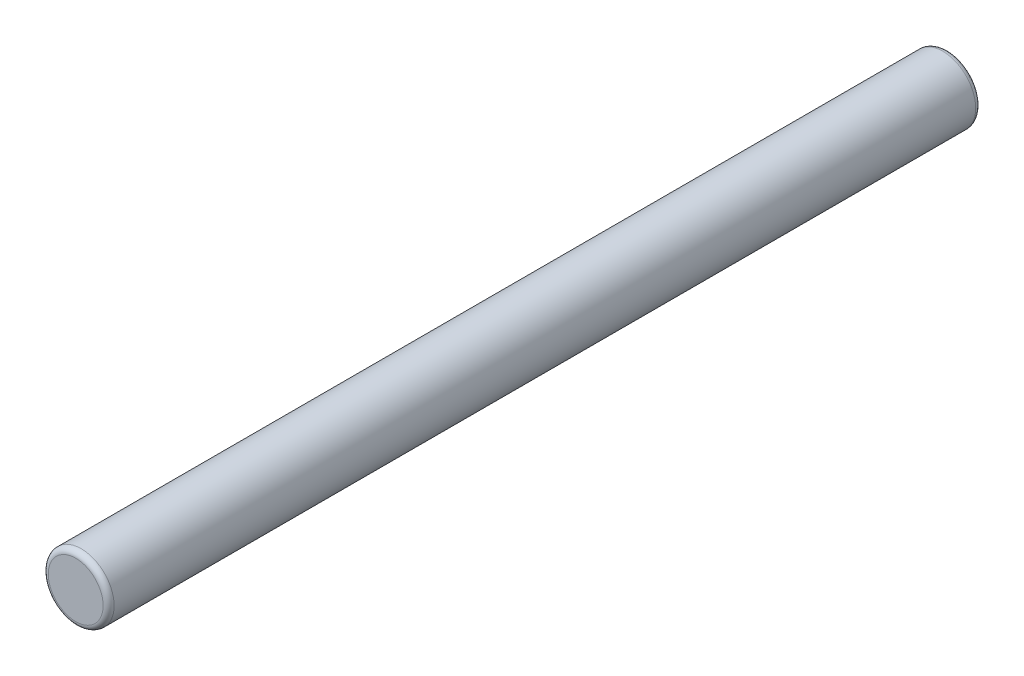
from build123d import *

# Parameters (mm, degrees)
SCHIZZO1_R                   = 6
ESTRUSIONE_ESTRUSIONE1_DEPTH = 79.5
RACCORDO1_R                  = 1


with BuildPart() as part:
    # Schizzo1 → Estrusione-Estrusione1 (new, symmetric)
    with BuildSketch(Plane.XY):
        with Locations(Location((0, 0, 0), (0, 0, 180))):
            Circle(SCHIZZO1_R)
    extrude(amount=ESTRUSIONE_ESTRUSIONE1_DEPTH, both=True)

    # Raccordo1
    raccordo1_edges = [part.edges().sort_by_distance(p)[0] for p in [
        (6, 0, -79.5),
        (6, 0, 79.5),
    ]]
    fillet(raccordo1_edges, radius=RACCORDO1_R)


solid = part.part
